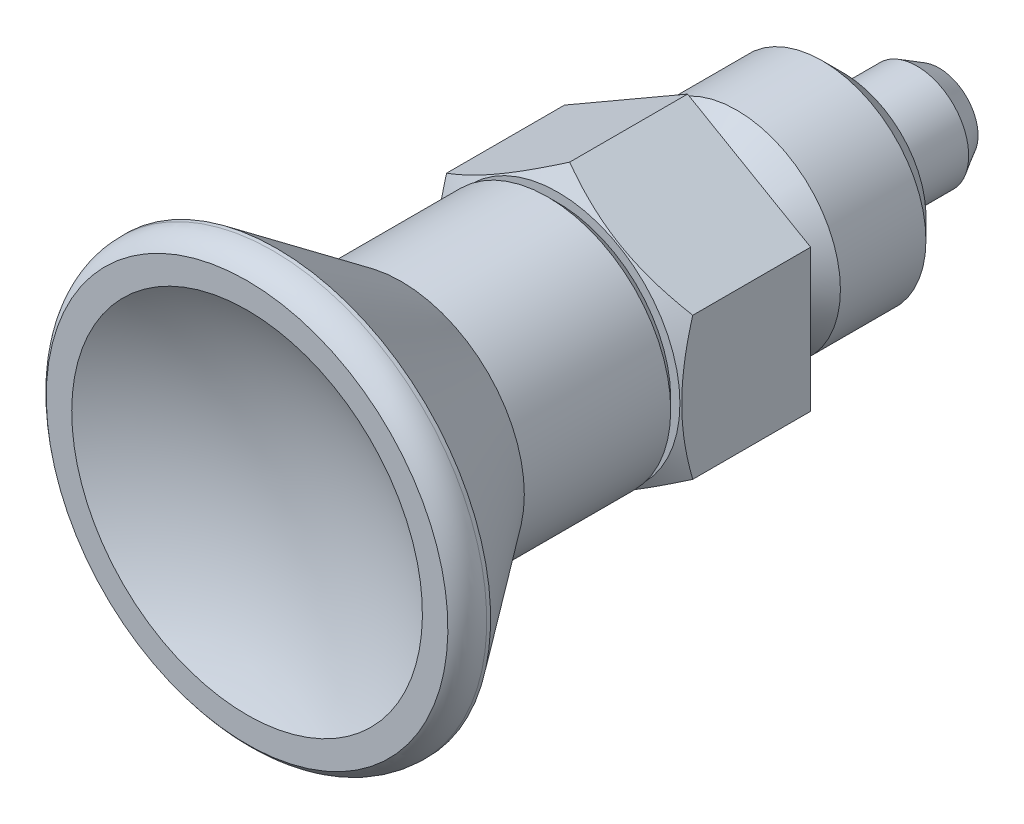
ISO-10303-21;
HEADER;
FILE_DESCRIPTION(('STEP AP214'),'2;1');
FILE_NAME('part.step','',(''),(''),'','','');
FILE_SCHEMA(('AUTOMOTIVE_DESIGN { 1 0 10303 214 1 1 1 1 }'));
ENDSEC;
DATA;
#1=APPLICATION_CONTEXT('core data for automotive mechanical design processes');
#2=APPLICATION_PROTOCOL_DEFINITION('international standard','automotive_design',2000,#1);
#3=PRODUCT_CONTEXT('',#1,'mechanical');
#4=PRODUCT('Part','Part','',(#3));
#5=PRODUCT_RELATED_PRODUCT_CATEGORY('part','',(#4));
#6=PRODUCT_DEFINITION_FORMATION('','',#4);
#7=PRODUCT_DEFINITION_CONTEXT('part definition',#1,'design');
#8=PRODUCT_DEFINITION('design','',#6,#7);
#9=PRODUCT_DEFINITION_SHAPE('','',#8);
#10=(LENGTH_UNIT() NAMED_UNIT(*) SI_UNIT(.MILLI.,.METRE.));
#11=(NAMED_UNIT(*) PLANE_ANGLE_UNIT() SI_UNIT($,.RADIAN.));
#12=(NAMED_UNIT(*) SI_UNIT($,.STERADIAN.) SOLID_ANGLE_UNIT());
#13=UNCERTAINTY_MEASURE_WITH_UNIT(LENGTH_MEASURE(1.E-05),#10,'distance_accuracy_value','');
#14=(GEOMETRIC_REPRESENTATION_CONTEXT(3) GLOBAL_UNCERTAINTY_ASSIGNED_CONTEXT((#13)) GLOBAL_UNIT_ASSIGNED_CONTEXT((#10,
#11,#12)) REPRESENTATION_CONTEXT('',''));
#15=CARTESIAN_POINT('',(0.,0.,0.));
#16=DIRECTION('',(0.,0.,1.));
#17=DIRECTION('',(1.,0.,0.));
#18=AXIS2_PLACEMENT_3D('',#15,#16,#17);
#19=CARTESIAN_POINT('',(0.,0.,-11.9999999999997));
#20=DIRECTION('',(-1.,0.,0.));
#21=DIRECTION('',(0.,1.,0.));
#22=AXIS2_PLACEMENT_3D('',#19,#20,#21);
#23=SPHERICAL_SURFACE('',#22,8.00000000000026);
#24=CARTESIAN_POINT('',(0.,0.,-19.4113534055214));
#25=DIRECTION('',(0.,0.,1.));
#26=DIRECTION('',(-1.,0.,0.));
#27=AXIS2_PLACEMENT_3D('',#24,#25,#26);
#28=CIRCLE('',#27,3.01194965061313);
#29=CARTESIAN_POINT('',(-3.01194965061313,0.,-19.4113534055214));
#30=VERTEX_POINT('',#29);
#31=EDGE_CURVE('E18',#30,#30,#28,.T.);
#32=ORIENTED_EDGE('',*,*,#31,.F.);
#33=EDGE_LOOP('',(#32));
#34=FACE_BOUND('',#33,.T.);
#35=ADVANCED_FACE('F14',(#34),#23,.T.);
#36=CARTESIAN_POINT('',(0.,0.,-17.7000000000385));
#37=DIRECTION('',(0.,0.,1.));
#38=DIRECTION('',(-1.,0.,0.));
#39=AXIS2_PLACEMENT_3D('',#36,#37,#38);
#40=CONICAL_SURFACE('',#39,3.99999999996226,0.523598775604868);
#41=CARTESIAN_POINT('',(0.,0.,-17.7));
#42=DIRECTION('',(0.,0.,1.));
#43=DIRECTION('',(0.,-1.,0.));
#44=AXIS2_PLACEMENT_3D('',#41,#42,#43);
#45=CIRCLE('',#44,4.);
#46=CARTESIAN_POINT('',(0.,-4.,-17.7));
#47=VERTEX_POINT('',#46);
#48=EDGE_CURVE('E266',#47,#47,#45,.T.);
#49=ORIENTED_EDGE('',*,*,#48,.F.);
#50=EDGE_LOOP('',(#49));
#51=FACE_BOUND('',#50,.T.);
#52=ORIENTED_EDGE('',*,*,#31,.T.);
#53=EDGE_LOOP('',(#52));
#54=FACE_BOUND('',#53,.T.);
#55=ADVANCED_FACE('F177',(#51,#54),#40,.T.);
#56=CARTESIAN_POINT('',(0.,0.,-20.));
#57=DIRECTION('',(0.,0.,1.));
#58=DIRECTION('',(0.,-1.,0.));
#59=AXIS2_PLACEMENT_3D('',#56,#57,#58);
#60=CYLINDRICAL_SURFACE('',#59,4.);
#61=CARTESIAN_POINT('',(0.,0.,-12.));
#62=DIRECTION('',(0.,0.,1.));
#63=DIRECTION('',(0.,-1.,0.));
#64=AXIS2_PLACEMENT_3D('',#61,#62,#63);
#65=CIRCLE('',#64,4.);
#66=CARTESIAN_POINT('',(0.,-4.,-12.));
#67=VERTEX_POINT('',#66);
#68=EDGE_CURVE('E269',#67,#67,#65,.F.);
#69=ORIENTED_EDGE('',*,*,#68,.T.);
#70=EDGE_LOOP('',(#69));
#71=FACE_BOUND('',#70,.T.);
#72=ORIENTED_EDGE('',*,*,#48,.T.);
#73=EDGE_LOOP('',(#72));
#74=FACE_BOUND('',#73,.T.);
#75=ADVANCED_FACE('F174',(#71,#74),#60,.T.);
#76=CARTESIAN_POINT('',(6.4,0.,-12.));
#77=DIRECTION('',(0.,0.,1.));
#78=DIRECTION('',(0.,-1.,0.));
#79=AXIS2_PLACEMENT_3D('',#76,#77,#78);
#80=PLANE('',#79);
#81=CARTESIAN_POINT('',(0.,0.,-12.));
#82=DIRECTION('',(0.,0.,1.));
#83=DIRECTION('',(-1.,0.,0.));
#84=AXIS2_PLACEMENT_3D('',#81,#82,#83);
#85=CIRCLE('',#84,6.4);
#86=CARTESIAN_POINT('',(-6.4,0.,-12.));
#87=VERTEX_POINT('',#86);
#88=EDGE_CURVE('E276',#87,#87,#85,.T.);
#89=ORIENTED_EDGE('',*,*,#88,.F.);
#90=EDGE_LOOP('',(#89));
#91=FACE_BOUND('',#90,.T.);
#92=ORIENTED_EDGE('',*,*,#68,.F.);
#93=EDGE_LOOP('',(#92));
#94=FACE_BOUND('',#93,.T.);
#95=ADVANCED_FACE('F170',(#91,#94),#80,.F.);
#96=CARTESIAN_POINT('',(0.,0.,-10.4));
#97=DIRECTION('',(0.,0.,1.));
#98=DIRECTION('',(-1.,0.,0.));
#99=AXIS2_PLACEMENT_3D('',#96,#97,#98);
#100=CONICAL_SURFACE('',#99,8.,0.785398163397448);
#101=CARTESIAN_POINT('',(0.,0.,-10.4));
#102=DIRECTION('',(0.,0.,1.));
#103=DIRECTION('',(0.,-1.,0.));
#104=AXIS2_PLACEMENT_3D('',#101,#102,#103);
#105=CIRCLE('',#104,8.);
#106=CARTESIAN_POINT('',(0.,-8.,-10.4));
#107=VERTEX_POINT('',#106);
#108=EDGE_CURVE('E272',#107,#107,#105,.T.);
#109=ORIENTED_EDGE('',*,*,#108,.F.);
#110=EDGE_LOOP('',(#109));
#111=FACE_BOUND('',#110,.T.);
#112=ORIENTED_EDGE('',*,*,#88,.T.);
#113=EDGE_LOOP('',(#112));
#114=FACE_BOUND('',#113,.T.);
#115=ADVANCED_FACE('F166',(#111,#114),#100,.T.);
#116=CARTESIAN_POINT('',(0.,0.,-12.));
#117=DIRECTION('',(0.,0.,1.));
#118=DIRECTION('',(0.,-1.,0.));
#119=AXIS2_PLACEMENT_3D('',#116,#117,#118);
#120=CYLINDRICAL_SURFACE('',#119,8.);
#121=CARTESIAN_POINT('',(0.,0.,-3.80000000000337));
#122=DIRECTION('',(0.,0.,-1.));
#123=DIRECTION('',(0.,1.,0.));
#124=AXIS2_PLACEMENT_3D('',#121,#122,#123);
#125=CIRCLE('',#124,7.99999999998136);
#126=CARTESIAN_POINT('',(0.,7.99999999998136,-3.80000000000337));
#127=VERTEX_POINT('',#126);
#128=EDGE_CURVE('E275',#127,#127,#125,.F.);
#129=ORIENTED_EDGE('',*,*,#128,.F.);
#130=EDGE_LOOP('',(#129));
#131=FACE_BOUND('',#130,.T.);
#132=ORIENTED_EDGE('',*,*,#108,.T.);
#133=EDGE_LOOP('',(#132));
#134=FACE_BOUND('',#133,.T.);
#135=ADVANCED_FACE('F162',(#131,#134),#120,.T.);
#136=CARTESIAN_POINT('',(0.,0.,-3.80000000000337));
#137=DIRECTION('',(0.,0.,-1.));
#138=DIRECTION('',(0.,1.,0.));
#139=AXIS2_PLACEMENT_3D('',#136,#137,#138);
#140=CONICAL_SURFACE('',#139,7.99999999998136,0.698131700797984);
#141=CARTESIAN_POINT('',(0.,0.,-1.93366090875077));
#142=DIRECTION('',(0.,0.,-1.));
#143=DIRECTION('',(0.,1.,0.));
#144=AXIS2_PLACEMENT_3D('',#141,#142,#143);
#145=CIRCLE('',#144,6.43395555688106);
#146=CARTESIAN_POINT('',(0.,6.43395555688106,-1.93366090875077));
#147=VERTEX_POINT('',#146);
#148=EDGE_CURVE('E149',#147,#147,#145,.T.);
#149=ORIENTED_EDGE('',*,*,#148,.T.);
#150=EDGE_LOOP('',(#149));
#151=FACE_BOUND('',#150,.T.);
#152=ORIENTED_EDGE('',*,*,#128,.T.);
#153=EDGE_LOOP('',(#152));
#154=FACE_BOUND('',#153,.T.);
#155=ADVANCED_FACE('F158',(#151,#154),#140,.T.);
#156=CARTESIAN_POINT('',(0.,0.,-1.2908732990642));
#157=DIRECTION('',(0.,0.,-1.));
#158=DIRECTION('',(0.,1.,0.));
#159=AXIS2_PLACEMENT_3D('',#156,#157,#158);
#160=TOROIDAL_SURFACE('',#159,7.2,0.999999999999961);
#161=CARTESIAN_POINT('',(0.,0.,-1.2908732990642));
#162=DIRECTION('',(0.,0.,1.));
#163=DIRECTION('',(0.,-1.,0.));
#164=AXIS2_PLACEMENT_3D('',#161,#162,#163);
#165=CIRCLE('',#164,6.2);
#166=CARTESIAN_POINT('',(0.,-6.2,-1.2908732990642));
#167=VERTEX_POINT('',#166);
#168=EDGE_CURVE('E136',#167,#167,#165,.T.);
#169=ORIENTED_EDGE('',*,*,#168,.F.);
#170=EDGE_LOOP('',(#169));
#171=FACE_BOUND('',#170,.T.);
#172=ORIENTED_EDGE('',*,*,#148,.F.);
#173=EDGE_LOOP('',(#172));
#174=FACE_BOUND('',#173,.T.);
#175=ADVANCED_FACE('F155',(#171,#174),#160,.F.);
#176=CARTESIAN_POINT('',(0.,0.,-12.));
#177=DIRECTION('',(0.,0.,1.));
#178=DIRECTION('',(0.,-1.,0.));
#179=AXIS2_PLACEMENT_3D('',#176,#177,#178);
#180=CYLINDRICAL_SURFACE('',#179,6.2);
#181=CARTESIAN_POINT('',(0.,0.,-1.));
#182=DIRECTION('',(0.,0.,-1.));
#183=DIRECTION('',(0.,1.,0.));
#184=AXIS2_PLACEMENT_3D('',#181,#182,#183);
#185=CIRCLE('',#184,6.2);
#186=CARTESIAN_POINT('',(0.,6.2,-1.));
#187=VERTEX_POINT('',#186);
#188=EDGE_CURVE('E133',#187,#187,#185,.T.);
#189=ORIENTED_EDGE('',*,*,#188,.T.);
#190=EDGE_LOOP('',(#189));
#191=FACE_BOUND('',#190,.T.);
#192=ORIENTED_EDGE('',*,*,#168,.T.);
#193=EDGE_LOOP('',(#192));
#194=FACE_BOUND('',#193,.T.);
#195=ADVANCED_FACE('F126',(#191,#194),#180,.T.);
#196=CARTESIAN_POINT('',(0.,0.,-1.));
#197=DIRECTION('',(0.,0.,-1.));
#198=DIRECTION('',(0.,1.,0.));
#199=AXIS2_PLACEMENT_3D('',#196,#197,#198);
#200=TOROIDAL_SURFACE('',#199,7.2,1.);
#201=CARTESIAN_POINT('',(0.,0.,0.));
#202=DIRECTION('',(0.,0.,-1.));
#203=DIRECTION('',(0.,1.,0.));
#204=AXIS2_PLACEMENT_3D('',#201,#202,#203);
#205=CIRCLE('',#204,7.2);
#206=CARTESIAN_POINT('',(0.,7.2,0.));
#207=VERTEX_POINT('',#206);
#208=EDGE_CURVE('E81',#207,#207,#205,.T.);
#209=ORIENTED_EDGE('',*,*,#208,.T.);
#210=EDGE_LOOP('',(#209));
#211=FACE_BOUND('',#210,.T.);
#212=ORIENTED_EDGE('',*,*,#188,.F.);
#213=EDGE_LOOP('',(#212));
#214=FACE_BOUND('',#213,.T.);
#215=ADVANCED_FACE('F119',(#211,#214),#200,.F.);
#216=CARTESIAN_POINT('',(24.,0.,0.));
#217=DIRECTION('',(0.,0.,1.));
#218=DIRECTION('',(0.,-1.,0.));
#219=AXIS2_PLACEMENT_3D('',#216,#217,#218);
#220=PLANE('',#219);
#221=DIRECTION('',(-0.866025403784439,0.5,0.));
#222=VECTOR('',#221,1.);
#223=CARTESIAN_POINT('',(9.5,5.48482755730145,0.));
#224=LINE('',#223,#222);
#225=CARTESIAN_POINT('',(9.5,5.48482755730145,0.));
#226=VERTEX_POINT('',#225);
#227=CARTESIAN_POINT('',(0.,10.9696551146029,0.));
#228=VERTEX_POINT('',#227);
#229=EDGE_CURVE('E88',#226,#228,#224,.T.);
#230=ORIENTED_EDGE('',*,*,#229,.F.);
#231=DIRECTION('',(0.,1.,0.));
#232=VECTOR('',#231,1.);
#233=CARTESIAN_POINT('',(9.5,-5.48482755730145,0.));
#234=LINE('',#233,#232);
#235=CARTESIAN_POINT('',(9.5,-5.48482755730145,0.));
#236=VERTEX_POINT('',#235);
#237=EDGE_CURVE('E84',#236,#226,#234,.T.);
#238=ORIENTED_EDGE('',*,*,#237,.F.);
#239=DIRECTION('',(0.866025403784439,0.5,0.));
#240=VECTOR('',#239,1.);
#241=CARTESIAN_POINT('',(0.,-10.9696551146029,0.));
#242=LINE('',#241,#240);
#243=CARTESIAN_POINT('',(0.,-10.9696551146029,0.));
#244=VERTEX_POINT('',#243);
#245=EDGE_CURVE('E60',#244,#236,#242,.T.);
#246=ORIENTED_EDGE('',*,*,#245,.F.);
#247=DIRECTION('',(0.866025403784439,-0.5,0.));
#248=VECTOR('',#247,1.);
#249=CARTESIAN_POINT('',(-9.5,-5.48482755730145,0.));
#250=LINE('',#249,#248);
#251=CARTESIAN_POINT('',(-9.5,-5.48482755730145,0.));
#252=VERTEX_POINT('',#251);
#253=EDGE_CURVE('E100',#252,#244,#250,.T.);
#254=ORIENTED_EDGE('',*,*,#253,.F.);
#255=DIRECTION('',(0.,-1.,0.));
#256=VECTOR('',#255,1.);
#257=CARTESIAN_POINT('',(-9.5,5.48482755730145,0.));
#258=LINE('',#257,#256);
#259=CARTESIAN_POINT('',(-9.5,5.48482755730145,0.));
#260=VERTEX_POINT('',#259);
#261=EDGE_CURVE('E65',#260,#252,#258,.T.);
#262=ORIENTED_EDGE('',*,*,#261,.F.);
#263=DIRECTION('',(-0.866025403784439,-0.5,0.));
#264=VECTOR('',#263,1.);
#265=CARTESIAN_POINT('',(0.,10.9696551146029,0.));
#266=LINE('',#265,#264);
#267=EDGE_CURVE('E353',#228,#260,#266,.T.);
#268=ORIENTED_EDGE('',*,*,#267,.F.);
#269=EDGE_LOOP('',(#230,#238,#246,#254,#262,#268));
#270=FACE_BOUND('',#269,.T.);
#271=ORIENTED_EDGE('',*,*,#208,.F.);
#272=EDGE_LOOP('',(#271));
#273=FACE_BOUND('',#272,.T.);
#274=ADVANCED_FACE('F85',(#270,#273),#220,.F.);
#275=CARTESIAN_POINT('',(0.,-10.9696551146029,0.));
#276=DIRECTION('',(0.5,-0.866025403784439,0.));
#277=DIRECTION('',(0.866025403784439,0.5,0.));
#278=AXIS2_PLACEMENT_3D('',#275,#276,#277);
#279=PLANE('',#278);
#280=ORIENTED_EDGE('',*,*,#245,.T.);
#281=DIRECTION('',(0.,0.,1.));
#282=VECTOR('',#281,1.);
#283=CARTESIAN_POINT('',(9.5,-5.48482755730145,0.));
#284=LINE('',#283,#282);
#285=CARTESIAN_POINT('',(9.5,-5.48482757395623,9.09999999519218));
#286=VERTEX_POINT('',#285);
#287=EDGE_CURVE('E77',#286,#236,#284,.F.);
#288=ORIENTED_EDGE('',*,*,#287,.F.);
#289=CARTESIAN_POINT('',(7.50020255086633E-08,-10.9696550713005,9.10000002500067));
#290=CARTESIAN_POINT('',(0.208829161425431,-10.8490875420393,9.16959626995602));
#291=CARTESIAN_POINT('',(0.418436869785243,-10.7280704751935,9.23603357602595));
#292=CARTESIAN_POINT('',(0.839333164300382,-10.4850658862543,9.36171382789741));
#293=CARTESIAN_POINT('',(1.05062227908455,-10.3630780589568,9.42095440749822));
#294=CARTESIAN_POINT('',(1.68789396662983,-9.99514907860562,9.5867345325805));
#295=CARTESIAN_POINT('',(2.11639219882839,-9.74775550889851,9.68102840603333));
#296=CARTESIAN_POINT('',(2.7576201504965,-9.37754237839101,9.79159481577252));
#297=CARTESIAN_POINT('',(2.96843428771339,-9.25582877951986,9.82309064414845));
#298=CARTESIAN_POINT('',(3.39103852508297,-9.01183810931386,9.87590619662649));
#299=CARTESIAN_POINT('',(3.60282864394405,-8.88956102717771,9.89722572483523));
#300=CARTESIAN_POINT('',(4.02676207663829,-8.64480294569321,9.92914241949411));
#301=CARTESIAN_POINT('',(4.23890466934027,-8.52232236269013,9.93975232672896));
#302=CARTESIAN_POINT('',(4.66338570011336,-8.27724812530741,9.95002433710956));
#303=CARTESIAN_POINT('',(4.87572413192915,-8.15465447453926,9.94968677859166));
#304=CARTESIAN_POINT('',(5.27268298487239,-7.92547017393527,9.93882622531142));
#305=CARTESIAN_POINT('',(5.45733144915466,-7.81886333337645,9.92962808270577));
#306=CARTESIAN_POINT('',(5.82619650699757,-7.6058989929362,9.90313181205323));
#307=CARTESIAN_POINT('',(6.01041306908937,-7.49954151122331,9.88583311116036));
#308=CARTESIAN_POINT('',(6.56234892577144,-7.18088119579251,9.82219509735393));
#309=CARTESIAN_POINT('',(6.92909129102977,-6.96914239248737,9.76412180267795));
#310=CARTESIAN_POINT('',(7.66646575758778,-6.54341904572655,9.61894057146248));
#311=CARTESIAN_POINT('',(8.03700377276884,-6.32948882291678,9.53121734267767));
#312=CARTESIAN_POINT('',(8.772554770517,-5.90481825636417,9.33212301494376));
#313=CARTESIAN_POINT('',(9.13757716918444,-5.69407247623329,9.22079866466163));
#314=CARTESIAN_POINT('',(9.49999992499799,-5.48482760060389,9.10000002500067));
#315=B_SPLINE_CURVE_WITH_KNOTS('',3,(#289,#290,#291,#292,#293,#294,#295,#296,#297,#298,#299,
#300,#301,#302,#303,#304,#305,#306,#307,#308,#309,#310,#311,#312,#313,#314),.UNSPECIFIED.,.F.,
.F.,(4,2,2,2,2,2,2,2,2,2,2,2,4),(0.,0.752872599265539,1.50599206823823,3.01543663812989,
3.7516341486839,4.48784583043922,5.22318063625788,5.95849271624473,6.59856919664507,
7.23869094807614,8.51984386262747,9.82940660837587,11.1363992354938),.UNSPECIFIED.);
#316=CARTESIAN_POINT('',(3.75010162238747E-08,-10.9696550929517,9.10000001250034));
#317=VERTEX_POINT('',#316);
#318=EDGE_CURVE('E52',#317,#286,#315,.T.);
#319=ORIENTED_EDGE('',*,*,#318,.F.);
#320=DIRECTION('',(0.,0.,1.));
#321=VECTOR('',#320,1.);
#322=CARTESIAN_POINT('',(0.,-10.9696551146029,0.));
#323=LINE('',#322,#321);
#324=EDGE_CURVE('E79',#244,#317,#323,.T.);
#325=ORIENTED_EDGE('',*,*,#324,.F.);
#326=EDGE_LOOP('',(#280,#288,#319,#325));
#327=FACE_BOUND('',#326,.T.);
#328=ADVANCED_FACE('F75',(#327),#279,.T.);
#329=CARTESIAN_POINT('',(9.5,-5.48482755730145,0.));
#330=DIRECTION('',(1.,0.,0.));
#331=DIRECTION('',(0.,1.,0.));
#332=AXIS2_PLACEMENT_3D('',#329,#330,#331);
#333=PLANE('',#332);
#334=ORIENTED_EDGE('',*,*,#237,.T.);
#335=DIRECTION('',(0.,0.,1.));
#336=VECTOR('',#335,1.);
#337=CARTESIAN_POINT('',(9.5,5.48482755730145,0.));
#338=LINE('',#337,#336);
#339=CARTESIAN_POINT('',(9.50000001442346,5.48482754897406,9.09999999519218));
#340=VERTEX_POINT('',#339);
#341=EDGE_CURVE('E91',#340,#226,#338,.F.);
#342=ORIENTED_EDGE('',*,*,#341,.F.);
#343=CARTESIAN_POINT('',(9.5,-5.48482759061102,9.09999999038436));
#344=CARTESIAN_POINT('',(9.5,-5.24369253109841,9.16959623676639));
#345=CARTESIAN_POINT('',(9.5,-5.00165839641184,9.23603354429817));
#346=CARTESIAN_POINT('',(9.5,-4.51564921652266,9.36171379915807));
#347=CARTESIAN_POINT('',(9.5,-4.27167356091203,9.4209543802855));
#348=CARTESIAN_POINT('',(9.5,-3.53581559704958,9.5867345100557));
#349=CARTESIAN_POINT('',(9.5,-3.04102845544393,9.68102838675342));
#350=CARTESIAN_POINT('',(9.5,-2.30060219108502,9.79159480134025));
#351=CARTESIAN_POINT('',(9.5,-2.05717499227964,9.82309063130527));
#352=CARTESIAN_POINT('',(9.5,-1.56919364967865,9.87590618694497));
#353=CARTESIAN_POINT('',(9.5,-1.32463948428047,9.89722571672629));
#354=CARTESIAN_POINT('',(9.5,-0.835123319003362,9.92914241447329));
#355=CARTESIAN_POINT('',(9.5,-0.590162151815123,9.93975232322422));
#356=CARTESIAN_POINT('',(9.5,-0.100013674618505,9.95002433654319));
#357=CARTESIAN_POINT('',(9.5,0.145173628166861,9.94968677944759));
#358=CARTESIAN_POINT('',(9.5,0.603542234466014,9.93882622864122));
#359=CARTESIAN_POINT('',(9.5,0.816755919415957,9.92962808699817));
#360=CARTESIAN_POINT('',(9.5,1.24268460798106,9.90313181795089));
#361=CARTESIAN_POINT('',(9.5,1.45539957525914,9.88583311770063));
#362=CARTESIAN_POINT('',(9.5,2.09272021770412,9.82219510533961));
#363=CARTESIAN_POINT('',(9.5,2.5161978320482,9.76412181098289));
#364=CARTESIAN_POINT('',(9.5,3.36764454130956,9.61894057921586));
#365=CARTESIAN_POINT('',(9.5,3.7955049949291,9.53121734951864));
#366=CARTESIAN_POINT('',(9.5,4.64484614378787,9.33212301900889));
#367=CARTESIAN_POINT('',(9.5,5.06633771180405,9.22079866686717));
#368=CARTESIAN_POINT('',(9.5,5.48482747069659,9.10000002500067));
#369=B_SPLINE_CURVE_WITH_KNOTS('',3,(#343,#344,#345,#346,#347,#348,#349,#350,#351,#352,#353,
#354,#355,#356,#357,#358,#359,#360,#361,#362,#363,#364,#365,#366,#367,#368),.UNSPECIFIED.,.F.,
.F.,(4,2,2,2,2,2,2,2,2,2,2,2,4),(0.,0.75287260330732,1.50599207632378,3.01543665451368,
3.75163416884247,4.48784585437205,5.22318066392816,5.95849274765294,6.59856923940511,
7.2386910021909,8.51984393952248,9.82940670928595,11.1363993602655),.UNSPECIFIED.);
#370=EDGE_CURVE('E95',#286,#340,#369,.T.);
#371=ORIENTED_EDGE('',*,*,#370,.F.);
#372=ORIENTED_EDGE('',*,*,#287,.T.);
#373=EDGE_LOOP('',(#334,#342,#371,#372));
#374=FACE_BOUND('',#373,.T.);
#375=ADVANCED_FACE('F93',(#374),#333,.T.);
#376=CARTESIAN_POINT('',(9.5,5.48482755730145,0.));
#377=DIRECTION('',(0.5,0.866025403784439,0.));
#378=DIRECTION('',(-0.866025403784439,0.5,0.));
#379=AXIS2_PLACEMENT_3D('',#376,#377,#378);
#380=PLANE('',#379);
#381=ORIENTED_EDGE('',*,*,#229,.T.);
#382=DIRECTION('',(0.,0.,1.));
#383=VECTOR('',#382,1.);
#384=CARTESIAN_POINT('',(0.,10.9696551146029,0.));
#385=LINE('',#384,#383);
#386=CARTESIAN_POINT('',(-1.15387723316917E-08,10.969655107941,9.10000000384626));
#387=VERTEX_POINT('',#386);
#388=EDGE_CURVE('E358',#387,#228,#385,.F.);
#389=ORIENTED_EDGE('',*,*,#388,.F.);
#390=CARTESIAN_POINT('',(9.50000002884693,5.48482754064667,9.09999999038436));
#391=CARTESIAN_POINT('',(9.29117094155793,5.60539507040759,9.16959623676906));
#392=CARTESIAN_POINT('',(9.08156323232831,5.72641213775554,9.23603354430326));
#393=CARTESIAN_POINT('',(8.6606669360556,5.9694167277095,9.36171379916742));
#394=CARTESIAN_POINT('',(8.44937782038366,6.09140455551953,9.42095438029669));
#395=CARTESIAN_POINT('',(7.81210613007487,6.45933353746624,9.5867345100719));
#396=CARTESIAN_POINT('',(7.38360789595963,6.70672710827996,9.68102838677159));
#397=CARTESIAN_POINT('',(6.74237994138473,7.07694024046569,9.79159480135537));
#398=CARTESIAN_POINT('',(6.53156580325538,7.19865383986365,9.82309063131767));
#399=CARTESIAN_POINT('',(6.10896156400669,7.44264451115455,9.87590618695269));
#400=CARTESIAN_POINT('',(5.89717144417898,7.56492159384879,9.89722571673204));
#401=CARTESIAN_POINT('',(5.47323800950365,7.80967967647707,9.92914241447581));
#402=CARTESIAN_POINT('',(5.26109541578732,7.93216026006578,9.93975232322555));
#403=CARTESIAN_POINT('',(4.83661438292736,8.17723449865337,9.95002433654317));
#404=CARTESIAN_POINT('',(4.62427595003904,8.29982815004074,9.9496867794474));
#405=CARTESIAN_POINT('',(4.22731709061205,8.52901245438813,9.93882622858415));
#406=CARTESIAN_POINT('',(4.04266862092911,8.63561929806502,9.92962808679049));
#407=CARTESIAN_POINT('',(3.67380355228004,8.84858364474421,9.90313181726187));
#408=CARTESIAN_POINT('',(3.48958698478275,8.95494112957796,9.88583311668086));
#409=CARTESIAN_POINT('',(2.9376511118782,9.27360145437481,9.82219510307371));
#410=CARTESIAN_POINT('',(2.57090873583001,9.48534026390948,9.76412180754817));
#411=CARTESIAN_POINT('',(1.83353424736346,9.9110636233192,9.61894057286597));
#412=CARTESIAN_POINT('',(1.46299622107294,10.124993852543,9.53121734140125));
#413=CARTESIAN_POINT('',(0.727445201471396,10.5496644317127,9.33212300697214));
#414=CARTESIAN_POINT('',(0.362422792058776,10.7604102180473,9.22079865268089));
#415=CARTESIAN_POINT('',(2.5660248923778E-08,10.9696550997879,9.10000000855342));
#416=B_SPLINE_CURVE_WITH_KNOTS('',3,(#390,#391,#392,#393,#394,#395,#396,#397,#398,#399,#400,
#401,#402,#403,#404,#405,#406,#407,#408,#409,#410,#411,#412,#413,#414,#415),.UNSPECIFIED.,.F.,
.F.,(4,2,2,2,2,2,2,2,2,2,2,2,4),(0.,0.752872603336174,1.50599207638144,3.01543665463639,
3.75163416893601,4.48784585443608,5.22318066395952,5.9584927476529,6.59856924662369,
7.23869101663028,8.51984396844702,9.82940675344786,11.1363994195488),.UNSPECIFIED.);
#417=EDGE_CURVE('E304',#340,#387,#416,.T.);
#418=ORIENTED_EDGE('',*,*,#417,.F.);
#419=ORIENTED_EDGE('',*,*,#341,.T.);
#420=EDGE_LOOP('',(#381,#389,#418,#419));
#421=FACE_BOUND('',#420,.T.);
#422=ADVANCED_FACE('F313',(#421),#380,.T.);
#423=CARTESIAN_POINT('',(0.,10.9696551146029,0.));
#424=DIRECTION('',(-0.5,0.866025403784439,0.));
#425=DIRECTION('',(-0.866025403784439,-0.5,0.));
#426=AXIS2_PLACEMENT_3D('',#423,#424,#425);
#427=PLANE('',#426);
#428=ORIENTED_EDGE('',*,*,#267,.T.);
#429=DIRECTION('',(0.,0.,1.));
#430=VECTOR('',#429,1.);
#431=CARTESIAN_POINT('',(-9.5,5.48482755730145,0.));
#432=LINE('',#431,#430);
#433=CARTESIAN_POINT('',(-9.5,5.48482757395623,9.09999999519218));
#434=VERTEX_POINT('',#433);
#435=EDGE_CURVE('E355',#434,#260,#432,.F.);
#436=ORIENTED_EDGE('',*,*,#435,.F.);
#437=CARTESIAN_POINT('',(-1.6535208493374E-08,10.9696550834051,9.09999999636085));
#438=CARTESIAN_POINT('',(-0.208829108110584,10.8490875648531,9.16959624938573));
#439=CARTESIAN_POINT('',(-0.418436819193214,10.7280705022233,9.2360335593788));
#440=CARTESIAN_POINT('',(-0.83933311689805,10.4850659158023,9.36171381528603));
#441=CARTESIAN_POINT('',(-1.05062223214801,10.3630780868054,9.42095439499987));
#442=CARTESIAN_POINT('',(-1.68789392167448,9.99514910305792,9.58673452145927));
#443=CARTESIAN_POINT('',(-2.11639215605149,9.74775553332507,9.68102839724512));
#444=CARTESIAN_POINT('',(-2.75762011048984,9.37754240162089,9.79159480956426));
#445=CARTESIAN_POINT('',(-2.96843424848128,9.2558288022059,9.82309063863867));
#446=CARTESIAN_POINT('',(-3.39103848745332,9.01183813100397,9.8759061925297));
#447=CARTESIAN_POINT('',(-3.60282860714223,8.88956104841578,9.89722572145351));
#448=CARTESIAN_POINT('',(-4.02676204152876,8.64480296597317,9.92914241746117));
#449=CARTESIAN_POINT('',(-4.23890463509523,8.52232238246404,9.9397523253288));
#450=CARTESIAN_POINT('',(-4.6633856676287,8.27724814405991,9.95002433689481));
#451=CARTESIAN_POINT('',(-4.87572410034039,8.1546544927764,9.94968677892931));
#452=CARTESIAN_POINT('',(-5.27268295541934,7.92547019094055,9.93882622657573));
#453=CARTESIAN_POINT('',(-5.45733142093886,7.818863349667,9.92962808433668));
#454=CARTESIAN_POINT('',(-5.82619648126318,7.6058990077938,9.90313181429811));
#455=CARTESIAN_POINT('',(-6.01041304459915,7.49954152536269,9.88583311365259));
#456=CARTESIAN_POINT('',(-6.56234890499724,7.18088120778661,9.82219510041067));
#457=CARTESIAN_POINT('',(-6.92909127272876,6.9691424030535,9.76412180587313));
#458=CARTESIAN_POINT('',(-7.66646574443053,6.54341905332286,9.6189405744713));
#459=CARTESIAN_POINT('',(-8.03700376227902,6.32948882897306,9.53121734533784));
#460=CARTESIAN_POINT('',(-8.77255476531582,5.9048182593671,9.33212301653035));
#461=CARTESIAN_POINT('',(-9.13757716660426,5.69407247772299,9.22079866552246));
#462=CARTESIAN_POINT('',(-9.49999992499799,5.48482760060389,9.10000002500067));
#463=B_SPLINE_CURVE_WITH_KNOTS('',3,(#437,#438,#439,#440,#441,#442,#443,#444,#445,#446,#447,
#448,#449,#450,#451,#452,#453,#454,#455,#456,#457,#458,#459,#460,#461,#462),.UNSPECIFIED.,.F.,
.F.,(4,2,2,2,2,2,2,2,2,2,2,2,4),(0.,0.752872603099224,1.50599207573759,3.01543665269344,
3.7516341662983,4.48784585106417,5.22318065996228,5.95849274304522,6.59856922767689,
7.2386909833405,8.51984390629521,9.829406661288,11.1363992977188),.UNSPECIFIED.);
#464=EDGE_CURVE('E325',#387,#434,#463,.T.);
#465=ORIENTED_EDGE('',*,*,#464,.F.);
#466=ORIENTED_EDGE('',*,*,#388,.T.);
#467=EDGE_LOOP('',(#428,#436,#465,#466));
#468=FACE_BOUND('',#467,.T.);
#469=ADVANCED_FACE('F317',(#468),#427,.T.);
#470=CARTESIAN_POINT('',(-9.5,5.48482755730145,0.));
#471=DIRECTION('',(-1.,0.,0.));
#472=DIRECTION('',(0.,-1.,0.));
#473=AXIS2_PLACEMENT_3D('',#470,#471,#472);
#474=PLANE('',#473);
#475=ORIENTED_EDGE('',*,*,#261,.T.);
#476=DIRECTION('',(0.,0.,1.));
#477=VECTOR('',#476,1.);
#478=CARTESIAN_POINT('',(-9.5,-5.48482755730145,0.));
#479=LINE('',#478,#477);
#480=CARTESIAN_POINT('',(-9.50000001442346,-5.48482754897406,9.09999999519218));
#481=VERTEX_POINT('',#480);
#482=EDGE_CURVE('E33',#481,#252,#479,.F.);
#483=ORIENTED_EDGE('',*,*,#482,.F.);
#484=CARTESIAN_POINT('',(-9.5,5.48482759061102,9.09999999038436));
#485=CARTESIAN_POINT('',(-9.5,5.24369253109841,9.16959623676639));
#486=CARTESIAN_POINT('',(-9.5,5.00165839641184,9.23603354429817));
#487=CARTESIAN_POINT('',(-9.5,4.51564921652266,9.36171379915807));
#488=CARTESIAN_POINT('',(-9.5,4.27167356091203,9.4209543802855));
#489=CARTESIAN_POINT('',(-9.5,3.53581559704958,9.58673451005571));
#490=CARTESIAN_POINT('',(-9.5,3.04102845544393,9.68102838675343));
#491=CARTESIAN_POINT('',(-9.5,2.30060219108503,9.79159480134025));
#492=CARTESIAN_POINT('',(-9.5,2.05717499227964,9.82309063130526));
#493=CARTESIAN_POINT('',(-9.5,1.56919364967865,9.87590618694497));
#494=CARTESIAN_POINT('',(-9.5,1.32463948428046,9.89722571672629));
#495=CARTESIAN_POINT('',(-9.5,0.835123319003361,9.92914241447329));
#496=CARTESIAN_POINT('',(-9.5,0.590162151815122,9.93975232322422));
#497=CARTESIAN_POINT('',(-9.5,0.100013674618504,9.95002433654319));
#498=CARTESIAN_POINT('',(-9.5,-0.145173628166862,9.94968677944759));
#499=CARTESIAN_POINT('',(-9.5,-0.603542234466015,9.93882622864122));
#500=CARTESIAN_POINT('',(-9.5,-0.816755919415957,9.92962808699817));
#501=CARTESIAN_POINT('',(-9.5,-1.24268460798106,9.90313181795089));
#502=CARTESIAN_POINT('',(-9.5,-1.45539957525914,9.88583311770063));
#503=CARTESIAN_POINT('',(-9.5,-2.09272021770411,9.82219510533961));
#504=CARTESIAN_POINT('',(-9.5,-2.5161978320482,9.76412181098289));
#505=CARTESIAN_POINT('',(-9.5,-3.36764454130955,9.61894057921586));
#506=CARTESIAN_POINT('',(-9.5,-3.7955049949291,9.53121734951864));
#507=CARTESIAN_POINT('',(-9.5,-4.64484614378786,9.3321230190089));
#508=CARTESIAN_POINT('',(-9.5,-5.06633771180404,9.22079866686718));
#509=CARTESIAN_POINT('',(-9.5,-5.48482747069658,9.10000002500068));
#510=B_SPLINE_CURVE_WITH_KNOTS('',3,(#484,#485,#486,#487,#488,#489,#490,#491,#492,#493,#494,
#495,#496,#497,#498,#499,#500,#501,#502,#503,#504,#505,#506,#507,#508,#509),.UNSPECIFIED.,.F.,
.F.,(4,2,2,2,2,2,2,2,2,2,2,2,4),(0.,0.75287260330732,1.50599207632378,3.01543665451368,
3.75163416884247,4.48784585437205,5.22318066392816,5.95849274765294,6.5985692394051,
7.2386910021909,8.51984393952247,9.82940670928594,11.1363993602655),.UNSPECIFIED.);
#511=EDGE_CURVE('E332',#434,#481,#510,.T.);
#512=ORIENTED_EDGE('',*,*,#511,.F.);
#513=ORIENTED_EDGE('',*,*,#435,.T.);
#514=EDGE_LOOP('',(#475,#483,#512,#513));
#515=FACE_BOUND('',#514,.T.);
#516=ADVANCED_FACE('F322',(#515),#474,.T.);
#517=CARTESIAN_POINT('',(-9.5,-5.48482755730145,0.));
#518=DIRECTION('',(-0.5,-0.866025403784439,0.));
#519=DIRECTION('',(0.866025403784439,-0.5,0.));
#520=AXIS2_PLACEMENT_3D('',#517,#518,#519);
#521=PLANE('',#520);
#522=ORIENTED_EDGE('',*,*,#253,.T.);
#523=ORIENTED_EDGE('',*,*,#324,.T.);
#524=CARTESIAN_POINT('',(-9.50000002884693,-5.48482754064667,9.09999999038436));
#525=CARTESIAN_POINT('',(-9.29117094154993,-5.60539507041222,9.16959623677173));
#526=CARTESIAN_POINT('',(-9.08156323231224,-5.72641213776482,9.23603354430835));
#527=CARTESIAN_POINT('',(-8.66066693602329,-5.96941672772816,9.36171379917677));
#528=CARTESIAN_POINT('',(-8.44937782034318,-6.09140455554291,9.42095438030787));
#529=CARTESIAN_POINT('',(-7.81210613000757,-6.4593335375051,9.5867345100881));
#530=CARTESIAN_POINT('',(-7.38360789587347,-6.7067271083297,9.68102838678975));
#531=CARTESIAN_POINT('',(-6.7423799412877,-7.07694024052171,9.79159480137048));
#532=CARTESIAN_POINT('',(-6.53156580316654,-7.19865383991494,9.82309063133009));
#533=CARTESIAN_POINT('',(-6.10896156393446,-7.44264451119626,9.87590618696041));
#534=CARTESIAN_POINT('',(-5.89717144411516,-7.56492159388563,9.89722571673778));
#535=CARTESIAN_POINT('',(-5.47323800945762,-7.80967967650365,9.92914241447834));
#536=CARTESIAN_POINT('',(-5.26109541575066,-7.93216026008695,9.93975232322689));
#537=CARTESIAN_POINT('',(-4.83661438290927,-8.17723449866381,9.95002433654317));
#538=CARTESIAN_POINT('',(-4.62427595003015,-8.29982815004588,9.94968677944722));
#539=CARTESIAN_POINT('',(-4.22731708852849,-8.52901245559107,9.93882622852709));
#540=CARTESIAN_POINT('',(-4.04266861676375,-8.63561930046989,9.92962808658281));
#541=CARTESIAN_POINT('',(-3.67380354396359,-8.84858364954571,9.90313181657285));
#542=CARTESIAN_POINT('',(-3.48958697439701,-8.95494113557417,9.88583311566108));
#543=CARTESIAN_POINT('',(-2.93765109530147,-9.27360146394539,9.82219510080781));
#544=CARTESIAN_POINT('',(-2.5709087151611,-9.48534027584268,9.76412180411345));
#545=CARTESIAN_POINT('',(-1.83353421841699,-9.91106364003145,9.61894056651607));
#546=CARTESIAN_POINT('',(-1.4629961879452,-10.1249938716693,9.53121733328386));
#547=CARTESIAN_POINT('',(-0.727445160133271,-10.5496644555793,9.3321229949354));
#548=CARTESIAN_POINT('',(-0.362422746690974,-10.7604102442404,9.22079863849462));
#549=CARTESIAN_POINT('',(2.36815149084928E-08,-10.9696551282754,9.09999999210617));
#550=B_SPLINE_CURVE_WITH_KNOTS('',3,(#524,#525,#526,#527,#528,#529,#530,#531,#532,#533,#534,
#535,#536,#537,#538,#539,#540,#541,#542,#543,#544,#545,#546,#547,#548,#549),.UNSPECIFIED.,.F.,
.F.,(4,2,2,2,2,2,2,2,2,2,2,2,4),(0.,0.752872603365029,1.50599207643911,3.01543665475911,
3.75163416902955,4.48784585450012,5.22318066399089,5.95849274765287,6.59856925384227,
7.23869103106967,8.51984399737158,9.8294067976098,11.1363994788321),.UNSPECIFIED.);
#551=EDGE_CURVE('E338',#481,#317,#550,.T.);
#552=ORIENTED_EDGE('',*,*,#551,.F.);
#553=ORIENTED_EDGE('',*,*,#482,.T.);
#554=EDGE_LOOP('',(#522,#523,#552,#553));
#555=FACE_BOUND('',#554,.T.);
#556=ADVANCED_FACE('F344',(#555),#521,.T.);
#557=CARTESIAN_POINT('',(0.,0.,9.0946));
#558=DIRECTION('',(0.,0.,-1.));
#559=DIRECTION('',(0.,1.,0.));
#560=AXIS2_PLACEMENT_3D('',#557,#558,#559);
#561=CONICAL_SURFACE('',#560,10.9790081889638,1.0471975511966);
#562=CARTESIAN_POINT('',(0.,0.,10.));
#563=DIRECTION('',(0.,0.,-1.));
#564=DIRECTION('',(0.,1.,0.));
#565=AXIS2_PLACEMENT_3D('',#562,#563,#564);
#566=CIRCLE('',#565,9.4108093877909);
#567=CARTESIAN_POINT('',(0.,9.4108093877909,10.));
#568=VERTEX_POINT('',#567);
#569=EDGE_CURVE('E239',#568,#568,#566,.T.);
#570=ORIENTED_EDGE('',*,*,#569,.T.);
#571=EDGE_LOOP('',(#570));
#572=FACE_BOUND('',#571,.T.);
#573=ORIENTED_EDGE('',*,*,#511,.T.);
#574=ORIENTED_EDGE('',*,*,#551,.T.);
#575=ORIENTED_EDGE('',*,*,#318,.T.);
#576=ORIENTED_EDGE('',*,*,#370,.T.);
#577=ORIENTED_EDGE('',*,*,#417,.T.);
#578=ORIENTED_EDGE('',*,*,#464,.T.);
#579=EDGE_LOOP('',(#573,#574,#575,#576,#577,#578));
#580=FACE_BOUND('',#579,.T.);
#581=ADVANCED_FACE('F226',(#572,#580),#561,.T.);
#582=CARTESIAN_POINT('',(0.,0.,56.2));
#583=DIRECTION('',(-1.,0.,0.));
#584=DIRECTION('',(0.,1.,0.));
#585=AXIS2_PLACEMENT_3D('',#582,#583,#584);
#586=SPHERICAL_SURFACE('',#585,26.);
#587=CARTESIAN_POINT('',(0.,13.5336617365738,34.));
#588=CARTESIAN_POINT('',(-0.38023272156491,13.5336644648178,34.));
#589=CARTESIAN_POINT('',(-0.760420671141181,13.5176310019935,34.));
#590=CARTESIAN_POINT('',(-1.5182211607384,13.4536090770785,34.));
#591=CARTESIAN_POINT('',(-1.89583299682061,13.4056122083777,34.));
#592=CARTESIAN_POINT('',(-2.64607170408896,13.2779239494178,34.));
#593=CARTESIAN_POINT('',(-3.01869277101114,13.1981984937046,34.));
#594=CARTESIAN_POINT('',(-3.75588877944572,13.0076223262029,34.));
#595=CARTESIAN_POINT('',(-4.12046375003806,12.8967717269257,34.));
#596=CARTESIAN_POINT('',(-4.83879771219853,12.6447950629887,34.));
#597=CARTESIAN_POINT('',(-5.19256185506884,12.5036836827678,34.));
#598=CARTESIAN_POINT('',(-5.88694906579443,12.1921547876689,34.));
#599=CARTESIAN_POINT('',(-6.22757192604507,12.0217368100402,34.));
#600=CARTESIAN_POINT('',(-6.8931632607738,11.6528552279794,34.));
#601=CARTESIAN_POINT('',(-7.21813570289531,11.454398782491,34.));
#602=CARTESIAN_POINT('',(-7.85020809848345,11.030818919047,34.));
#603=CARTESIAN_POINT('',(-8.15730812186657,10.8056956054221,34.));
#604=CARTESIAN_POINT('',(-8.75148587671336,10.3303561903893,34.));
#605=CARTESIAN_POINT('',(-9.03856147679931,10.080137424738,34.));
#606=CARTESIAN_POINT('',(-9.59061394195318,9.55640563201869,34.));
#607=CARTESIAN_POINT('',(-9.85559078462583,9.28289258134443,34.));
#608=CARTESIAN_POINT('',(-10.3615715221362,8.71450579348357,34.));
#609=CARTESIAN_POINT('',(-10.6025744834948,8.41963122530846,34.));
#610=CARTESIAN_POINT('',(-11.0588822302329,7.810627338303,34.));
#611=CARTESIAN_POINT('',(-11.2741870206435,7.49649802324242,34.));
#612=CARTESIAN_POINT('',(-11.6775639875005,6.85122394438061,34.));
#613=CARTESIAN_POINT('',(-11.8656366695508,6.52007949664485,34.));
#614=CARTESIAN_POINT('',(-12.2132170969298,5.84312402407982,34.));
#615=CARTESIAN_POINT('',(-12.3727248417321,5.4973129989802,34.));
#616=CARTESIAN_POINT('',(-12.6620410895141,4.79348360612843,34.));
#617=CARTESIAN_POINT('',(-12.7918496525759,4.43546526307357,34.));
#618=CARTESIAN_POINT('',(-13.0208450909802,3.70976586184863,34.));
#619=CARTESIAN_POINT('',(-13.1200319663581,3.3420848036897,34.));
#620=CARTESIAN_POINT('',(-13.287079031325,2.59967324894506,34.));
#621=CARTESIAN_POINT('',(-13.3549391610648,2.2249427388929,34.));
#622=CARTESIAN_POINT('',(-13.4588500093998,1.47109707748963,34.));
#623=CARTESIAN_POINT('',(-13.4949007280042,1.09198192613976,34.));
#624=CARTESIAN_POINT('',(-13.534936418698,0.332062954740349,34.));
#625=CARTESIAN_POINT('',(-13.5389214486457,-0.048740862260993,34.));
#626=CARTESIAN_POINT('',(-13.5147975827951,-0.809330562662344,34.));
#627=CARTESIAN_POINT('',(-13.4866886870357,-1.18911644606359,34.));
#628=CARTESIAN_POINT('',(-13.3985767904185,-1.94497037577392,34.));
#629=CARTESIAN_POINT('',(-13.3385737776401,-2.32103842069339,34.));
#630=CARTESIAN_POINT('',(-13.1871002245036,-3.06678291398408,34.));
#631=CARTESIAN_POINT('',(-13.0956296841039,-3.43645936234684,34.));
#632=CARTESIAN_POINT('',(-12.8818712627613,-4.16679287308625,34.));
#633=CARTESIAN_POINT('',(-12.7595833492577,-4.52744992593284,34.));
#634=CARTESIAN_POINT('',(-12.4850596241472,-5.23718018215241,34.));
#635=CARTESIAN_POINT('',(-12.332823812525,-5.58625338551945,34.));
#636=CARTESIAN_POINT('',(-11.9994866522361,-6.27033412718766,34.));
#637=CARTESIAN_POINT('',(-11.8183853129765,-6.60534167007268,34.));
#638=CARTESIAN_POINT('',(-11.4286045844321,-7.25890950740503,34.));
#639=CARTESIAN_POINT('',(-11.2199251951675,-7.57746980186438,34.));
#640=CARTESIAN_POINT('',(-10.7764720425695,-8.19587824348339,34.));
#641=CARTESIAN_POINT('',(-10.541698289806,-8.49572639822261,34.));
#642=CARTESIAN_POINT('',(-10.0477254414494,-9.07457896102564,34.));
#643=CARTESIAN_POINT('',(-9.78852634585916,-9.35358336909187,34.));
#644=CARTESIAN_POINT('',(-9.24754552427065,-9.88876492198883,34.));
#645=CARTESIAN_POINT('',(-8.96576379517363,-10.1449420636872,34.));
#646=CARTESIAN_POINT('',(-8.38162103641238,-10.6326477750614,34.));
#647=CARTESIAN_POINT('',(-8.079260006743,-10.864176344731,34.));
#648=CARTESIAN_POINT('',(-7.45610821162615,-11.3009389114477,34.));
#649=CARTESIAN_POINT('',(-7.13531744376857,-11.5061729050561,34.));
#650=CARTESIAN_POINT('',(-6.47758683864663,-11.8888871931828,34.));
#651=CARTESIAN_POINT('',(-6.14064700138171,-12.0663674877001,34.));
#652=CARTESIAN_POINT('',(-5.45301371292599,-12.3923125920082,34.));
#653=CARTESIAN_POINT('',(-5.10232026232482,-12.5407774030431,34.));
#654=CARTESIAN_POINT('',(-4.3896729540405,-12.8076360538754,34.));
#655=CARTESIAN_POINT('',(-4.02771909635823,-12.9260298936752,34.));
#656=CARTESIAN_POINT('',(-3.29512426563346,-13.1319048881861,34.));
#657=CARTESIAN_POINT('',(-2.92448329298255,-13.2193860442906,34.));
#658=CARTESIAN_POINT('',(-2.17714925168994,-13.3628137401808,34.));
#659=CARTESIAN_POINT('',(-1.80045618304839,-13.4187602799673,34.));
#660=CARTESIAN_POINT('',(-1.04369601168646,-13.4987209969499,34.));
#661=CARTESIAN_POINT('',(-0.663628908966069,-13.5227351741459,34.));
#662=CARTESIAN_POINT('',(0.0971772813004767,-13.538660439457,34.));
#663=CARTESIAN_POINT('',(0.47791636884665,-13.5305715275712,34.));
#664=CARTESIAN_POINT('',(1.23735971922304,-13.4823481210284,34.));
#665=CARTESIAN_POINT('',(1.61606398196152,-13.4422136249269,34.));
#666=CARTESIAN_POINT('',(2.36874530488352,-13.3301843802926,34.));
#667=CARTESIAN_POINT('',(2.74272236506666,-13.2582896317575,34.));
#668=CARTESIAN_POINT('',(3.48329054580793,-13.0832510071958,34.));
#669=CARTESIAN_POINT('',(3.84988166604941,-12.9801071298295,34.));
#670=CARTESIAN_POINT('',(4.57307170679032,-12.7433035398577,34.));
#671=CARTESIAN_POINT('',(4.9296706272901,-12.6096438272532,34.));
#672=CARTESIAN_POINT('',(5.63034101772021,-12.3127588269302,34.));
#673=CARTESIAN_POINT('',(5.9744124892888,-12.149533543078,34.));
#674=CARTESIAN_POINT('',(6.6475818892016,-11.794677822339,34.));
#675=CARTESIAN_POINT('',(6.97667981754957,-11.6030473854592,34.));
#676=CARTESIAN_POINT('',(7.61756239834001,-11.1927437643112,34.));
#677=CARTESIAN_POINT('',(7.92934705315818,-10.9740705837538,34.));
#678=CARTESIAN_POINT('',(8.53338653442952,-10.5112360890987,34.));
#679=CARTESIAN_POINT('',(8.82564136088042,-10.2670747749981,34.));
#680=CARTESIAN_POINT('',(9.38854354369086,-9.75499974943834,34.));
#681=CARTESIAN_POINT('',(9.65919089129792,-9.48708602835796,34.));
#682=CARTESIAN_POINT('',(10.1769538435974,-8.92941097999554,34.));
#683=CARTESIAN_POINT('',(10.4240694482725,-8.63964965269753,34.));
#684=CARTESIAN_POINT('',(10.8930121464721,-8.04033932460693,34.));
#685=CARTESIAN_POINT('',(11.1148392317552,-7.73079031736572,34.));
#686=CARTESIAN_POINT('',(11.5316277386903,-7.09410542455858,34.));
#687=CARTESIAN_POINT('',(11.7265891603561,-6.76696953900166,34.));
#688=CARTESIAN_POINT('',(12.0882600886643,-6.09743698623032,34.));
#689=CARTESIAN_POINT('',(12.2549696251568,-5.75504033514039,34.));
#690=CARTESIAN_POINT('',(12.5589518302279,-5.05742016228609,34.));
#691=CARTESIAN_POINT('',(12.6962244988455,-4.70219664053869,34.));
#692=CARTESIAN_POINT('',(12.9403569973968,-3.98144828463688,34.));
#693=CARTESIAN_POINT('',(13.0472168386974,-3.61592345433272,34.));
#694=CARTESIAN_POINT('',(13.2297640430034,-2.87717101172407,34.));
#695=CARTESIAN_POINT('',(13.3054514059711,-2.50394339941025,34.));
#696=CARTESIAN_POINT('',(13.4251156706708,-1.75243813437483,34.));
#697=CARTESIAN_POINT('',(13.4690925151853,-1.37416047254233,34.));
#698=CARTESIAN_POINT('',(13.5250228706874,-0.615245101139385,34.));
#699=CARTESIAN_POINT('',(13.5369763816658,-0.23460739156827,34.));
#700=CARTESIAN_POINT('',(13.5287750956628,0.526321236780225,34.));
#701=CARTESIAN_POINT('',(13.5086203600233,0.906612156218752,34.));
#702=CARTESIAN_POINT('',(13.436345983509,1.66414429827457,34.));
#703=CARTESIAN_POINT('',(13.3842263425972,2.04138552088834,34.));
#704=CARTESIAN_POINT('',(13.2483925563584,2.79013707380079,34.));
#705=CARTESIAN_POINT('',(13.1646783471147,3.16164739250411,34.));
#706=CARTESIAN_POINT('',(12.9662505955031,3.89629512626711,34.));
#707=CARTESIAN_POINT('',(12.8515370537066,4.25943254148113,34.));
#708=CARTESIAN_POINT('',(12.5919237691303,4.97475942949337,34.));
#709=CARTESIAN_POINT('',(12.4470234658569,5.32694869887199,34.));
#710=CARTESIAN_POINT('',(12.1280681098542,6.01786835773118,34.));
#711=CARTESIAN_POINT('',(11.954013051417,6.35659874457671,34.));
#712=CARTESIAN_POINT('',(11.5779930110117,7.01817940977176,34.));
#713=CARTESIAN_POINT('',(11.3760291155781,7.34103030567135,34.));
#714=CARTESIAN_POINT('',(10.9456222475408,7.96857061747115,34.));
#715=CARTESIAN_POINT('',(10.7171793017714,8.27326005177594,34.));
#716=CARTESIAN_POINT('',(10.2354638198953,8.86228038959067,34.));
#717=CARTESIAN_POINT('',(9.98219392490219,9.14661345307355,34.));
#718=CARTESIAN_POINT('',(9.45260334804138,9.69293683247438,34.));
#719=CARTESIAN_POINT('',(9.17628257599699,9.95492706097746,34.));
#720=CARTESIAN_POINT('',(8.60248181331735,10.4547651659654,34.));
#721=CARTESIAN_POINT('',(8.30499644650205,10.6926068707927,34.));
#722=CARTESIAN_POINT('',(7.69104951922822,11.1423768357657,34.));
#723=CARTESIAN_POINT('',(7.37458825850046,11.3543055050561,34.));
#724=CARTESIAN_POINT('',(6.72477752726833,11.7508429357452,34.));
#725=CARTESIAN_POINT('',(6.39141995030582,11.9354384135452,34.));
#726=CARTESIAN_POINT('',(5.71033156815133,12.2758732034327,34.));
#727=CARTESIAN_POINT('',(5.36260071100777,12.4317124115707,34.));
#728=CARTESIAN_POINT('',(4.65561466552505,12.7133738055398,34.));
#729=CARTESIAN_POINT('',(4.2963722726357,12.8392280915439,34.));
#730=CARTESIAN_POINT('',(3.56868576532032,13.0602093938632,34.));
#731=CARTESIAN_POINT('',(3.2002440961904,13.1553444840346,34.));
#732=CARTESIAN_POINT('',(2.36403699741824,13.3340438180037,34.));
#733=CARTESIAN_POINT('',(1.89437148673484,13.4088370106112,34.));
#734=CARTESIAN_POINT('',(0.949780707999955,13.508644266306,34.));
#735=CARTESIAN_POINT('',(0.474855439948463,13.5336583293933,34.));
#736=CARTESIAN_POINT('',(0.,13.5336617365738,34.));
#737=B_SPLINE_CURVE_WITH_KNOTS('',3,(#587,#588,#589,#590,#591,#592,#593,#594,#595,#596,#597,
#598,#599,#600,#601,#602,#603,#604,#605,#606,#607,#608,#609,#610,#611,#612,#613,#614,#615,#616,
#617,#618,#619,#620,#621,#622,#623,#624,#625,#626,#627,#628,#629,#630,#631,#632,#633,#634,#635,
#636,#637,#638,#639,#640,#641,#642,#643,#644,#645,#646,#647,#648,#649,#650,#651,#652,#653,#654,
#655,#656,#657,#658,#659,#660,#661,#662,#663,#664,#665,#666,#667,#668,#669,#670,#671,#672,#673,
#674,#675,#676,#677,#678,#679,#680,#681,#682,#683,#684,#685,#686,#687,#688,#689,#690,#691,#692,
#693,#694,#695,#696,#697,#698,#699,#700,#701,#702,#703,#704,#705,#706,#707,#708,#709,#710,#711,
#712,#713,#714,#715,#716,#717,#718,#719,#720,#721,#722,#723,#724,#725,#726,#727,#728,#729,#730,
#731,#732,#733,#734,#735,#736),.UNSPECIFIED.,.T.,.F.,(4,2,2,2,2,2,2,2,2,2,2,2,2,2,2,2,2,2,2,2,2,
2,2,2,2,2,2,2,2,2,2,2,2,2,2,2,2,2,2,2,2,2,2,2,2,2,2,2,2,2,2,2,2,2,2,2,2,2,2,2,2,2,2,2,2,2,2,2,2,
2,2,2,2,2,4),(0.,1.14028337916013,2.28086677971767,3.42267808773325,4.56448526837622,
5.7057396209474,6.84701199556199,7.98799349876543,9.12897053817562,10.2700688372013,
11.4111682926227,12.5523121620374,13.6934558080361,14.8345782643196,15.9757007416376,
17.1168209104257,18.257941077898,19.3990634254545,20.5401857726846,21.6813060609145,
22.82242634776,23.9635470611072,25.1046677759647,26.2457896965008,27.3869116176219,
28.5280331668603,29.6691547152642,30.8102758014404,31.9513968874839,33.0925181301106,
34.2336393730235,35.3747607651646,36.5158821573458,37.657003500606,38.7981248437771,
39.9392461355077,41.0803674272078,42.2214887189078,43.3626100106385,44.5037313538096,
45.6448526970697,46.7859740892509,47.9270954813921,49.068216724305,50.2093379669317,
51.3504590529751,52.4915801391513,53.6327016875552,54.7738232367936,55.9149451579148,
57.0560670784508,58.1971877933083,59.3383085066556,60.479428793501,61.620549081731,
62.761671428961,63.9027937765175,65.0439139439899,66.1850341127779,67.3261565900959,
68.4672790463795,69.6084226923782,70.7495665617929,71.8906660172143,73.0317643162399,
74.1727413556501,75.3137228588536,76.4549952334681,77.5962495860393,78.7380567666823,
79.8798680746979,81.0204514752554,82.1607348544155,83.5847831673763,85.0088314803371),.UNSPECIFIED.);
#738=CARTESIAN_POINT('',(0.,13.5336617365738,34.));
#739=VERTEX_POINT('',#738);
#740=EDGE_CURVE('E231',#739,#739,#737,.T.);
#741=ORIENTED_EDGE('',*,*,#740,.T.);
#742=EDGE_LOOP('',(#741));
#743=FACE_BOUND('',#742,.T.);
#744=ADVANCED_FACE('F220',(#743),#586,.F.);
#745=CARTESIAN_POINT('',(0.,0.,10.));
#746=DIRECTION('',(0.,0.,-1.));
#747=DIRECTION('',(0.,1.,0.));
#748=AXIS2_PLACEMENT_3D('',#745,#746,#747);
#749=PLANE('',#748);
#750=CARTESIAN_POINT('',(0.,0.,10.));
#751=DIRECTION('',(0.,0.,1.));
#752=DIRECTION('',(-1.,0.,0.));
#753=AXIS2_PLACEMENT_3D('',#750,#751,#752);
#754=CIRCLE('',#753,8.7);
#755=CARTESIAN_POINT('',(-8.7,0.,10.));
#756=VERTEX_POINT('',#755);
#757=EDGE_CURVE('E238',#756,#756,#754,.T.);
#758=ORIENTED_EDGE('',*,*,#757,.F.);
#759=EDGE_LOOP('',(#758));
#760=FACE_BOUND('',#759,.T.);
#761=ORIENTED_EDGE('',*,*,#569,.F.);
#762=EDGE_LOOP('',(#761));
#763=FACE_BOUND('',#762,.T.);
#764=ADVANCED_FACE('F225',(#760,#763),#749,.F.);
#765=CARTESIAN_POINT('',(13.5336617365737,0.,34.));
#766=DIRECTION('',(0.,0.,-1.));
#767=DIRECTION('',(0.,1.,0.));
#768=AXIS2_PLACEMENT_3D('',#765,#766,#767);
#769=PLANE('',#768);
#770=ORIENTED_EDGE('',*,*,#740,.F.);
#771=EDGE_LOOP('',(#770));
#772=FACE_BOUND('',#771,.T.);
#773=CARTESIAN_POINT('',(0.,0.,34.));
#774=DIRECTION('',(0.,0.,-1.));
#775=DIRECTION('',(0.,1.,0.));
#776=AXIS2_PLACEMENT_3D('',#773,#774,#775);
#777=CIRCLE('',#776,15.5);
#778=CARTESIAN_POINT('',(0.,15.5,34.));
#779=VERTEX_POINT('',#778);
#780=EDGE_CURVE('E256',#779,#779,#777,.T.);
#781=ORIENTED_EDGE('',*,*,#780,.F.);
#782=EDGE_LOOP('',(#781));
#783=FACE_BOUND('',#782,.T.);
#784=ADVANCED_FACE('F242',(#772,#783),#769,.F.);
#785=CARTESIAN_POINT('',(0.,0.,10.8));
#786=DIRECTION('',(0.,0.,1.));
#787=DIRECTION('',(-1.,0.,0.));
#788=AXIS2_PLACEMENT_3D('',#785,#786,#787);
#789=CONICAL_SURFACE('',#788,9.5,0.785398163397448);
#790=CARTESIAN_POINT('',(0.,0.,10.8));
#791=DIRECTION('',(0.,0.,1.));
#792=DIRECTION('',(0.,-1.,0.));
#793=AXIS2_PLACEMENT_3D('',#790,#791,#792);
#794=CIRCLE('',#793,9.5);
#795=CARTESIAN_POINT('',(0.,-9.5,10.8));
#796=VERTEX_POINT('',#795);
#797=EDGE_CURVE('E258',#796,#796,#794,.T.);
#798=ORIENTED_EDGE('',*,*,#797,.F.);
#799=EDGE_LOOP('',(#798));
#800=FACE_BOUND('',#799,.T.);
#801=ORIENTED_EDGE('',*,*,#757,.T.);
#802=EDGE_LOOP('',(#801));
#803=FACE_BOUND('',#802,.T.);
#804=ADVANCED_FACE('F208',(#800,#803),#789,.T.);
#805=CARTESIAN_POINT('',(0.,0.,32.));
#806=DIRECTION('',(0.,0.,-1.));
#807=DIRECTION('',(0.,1.,0.));
#808=AXIS2_PLACEMENT_3D('',#805,#806,#807);
#809=TOROIDAL_SURFACE('',#808,14.,2.5);
#810=CARTESIAN_POINT('',(0.,0.,32.));
#811=DIRECTION('',(0.,0.,1.));
#812=DIRECTION('',(0.,-1.,0.));
#813=AXIS2_PLACEMENT_3D('',#810,#811,#812);
#814=CIRCLE('',#813,16.5);
#815=CARTESIAN_POINT('',(0.,-16.5,32.));
#816=VERTEX_POINT('',#815);
#817=EDGE_CURVE('E260',#816,#816,#814,.F.);
#818=ORIENTED_EDGE('',*,*,#817,.F.);
#819=EDGE_LOOP('',(#818));
#820=FACE_BOUND('',#819,.T.);
#821=ORIENTED_EDGE('',*,*,#780,.T.);
#822=EDGE_LOOP('',(#821));
#823=FACE_BOUND('',#822,.T.);
#824=ADVANCED_FACE('F203',(#820,#823),#809,.T.);
#825=CARTESIAN_POINT('',(0.,0.,-20.));
#826=DIRECTION('',(0.,0.,1.));
#827=DIRECTION('',(0.,-1.,0.));
#828=AXIS2_PLACEMENT_3D('',#825,#826,#827);
#829=CYLINDRICAL_SURFACE('',#828,9.5);
#830=CARTESIAN_POINT('',(0.,0.,22.100603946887));
#831=DIRECTION('',(0.,0.,1.));
#832=DIRECTION('',(0.,-1.,0.));
#833=AXIS2_PLACEMENT_3D('',#830,#831,#832);
#834=CIRCLE('',#833,9.5);
#835=CARTESIAN_POINT('',(0.,-9.5,22.100603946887));
#836=VERTEX_POINT('',#835);
#837=EDGE_CURVE('E24',#836,#836,#834,.T.);
#838=ORIENTED_EDGE('',*,*,#837,.F.);
#839=EDGE_LOOP('',(#838));
#840=FACE_BOUND('',#839,.T.);
#841=ORIENTED_EDGE('',*,*,#797,.T.);
#842=EDGE_LOOP('',(#841));
#843=FACE_BOUND('',#842,.T.);
#844=ADVANCED_FACE('F196',(#840,#843),#829,.T.);
#845=CARTESIAN_POINT('',(0.,0.,-20.));
#846=DIRECTION('',(0.,0.,1.));
#847=DIRECTION('',(0.,-1.,0.));
#848=AXIS2_PLACEMENT_3D('',#845,#846,#847);
#849=CYLINDRICAL_SURFACE('',#848,16.5);
#850=ORIENTED_EDGE('',*,*,#817,.T.);
#851=EDGE_LOOP('',(#850));
#852=FACE_BOUND('',#851,.T.);
#853=CARTESIAN_POINT('',(0.,0.,31.7));
#854=DIRECTION('',(0.,0.,1.));
#855=DIRECTION('',(0.,-1.,0.));
#856=AXIS2_PLACEMENT_3D('',#853,#854,#855);
#857=CIRCLE('',#856,16.5);
#858=CARTESIAN_POINT('',(0.,-16.5,31.7));
#859=VERTEX_POINT('',#858);
#860=EDGE_CURVE('E9',#859,#859,#857,.F.);
#861=ORIENTED_EDGE('',*,*,#860,.F.);
#862=EDGE_LOOP('',(#861));
#863=FACE_BOUND('',#862,.T.);
#864=ADVANCED_FACE('F190',(#852,#863),#849,.T.);
#865=CARTESIAN_POINT('',(0.,0.,31.7));
#866=DIRECTION('',(0.,0.,1.));
#867=DIRECTION('',(-1.,0.,0.));
#868=AXIS2_PLACEMENT_3D('',#865,#866,#867);
#869=CONICAL_SURFACE('',#868,16.5,0.630063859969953);
#870=ORIENTED_EDGE('',*,*,#860,.T.);
#871=EDGE_LOOP('',(#870));
#872=FACE_BOUND('',#871,.T.);
#873=ORIENTED_EDGE('',*,*,#837,.T.);
#874=EDGE_LOOP('',(#873));
#875=FACE_BOUND('',#874,.T.);
#876=ADVANCED_FACE('F188',(#872,#875),#869,.T.);
#877=CLOSED_SHELL('',(#35,#55,#75,#95,#115,#135,#155,#175,#195,#215,#274,#328,#375,#422,#469,
#516,#556,#581,#744,#764,#784,#804,#824,#844,#864,#876));
#878=MANIFOLD_SOLID_BREP('B1',#877);
#879=ADVANCED_BREP_SHAPE_REPRESENTATION('',(#18,#878),#14);
#880=SHAPE_DEFINITION_REPRESENTATION(#9,#879);
ENDSEC;
END-ISO-10303-21;
